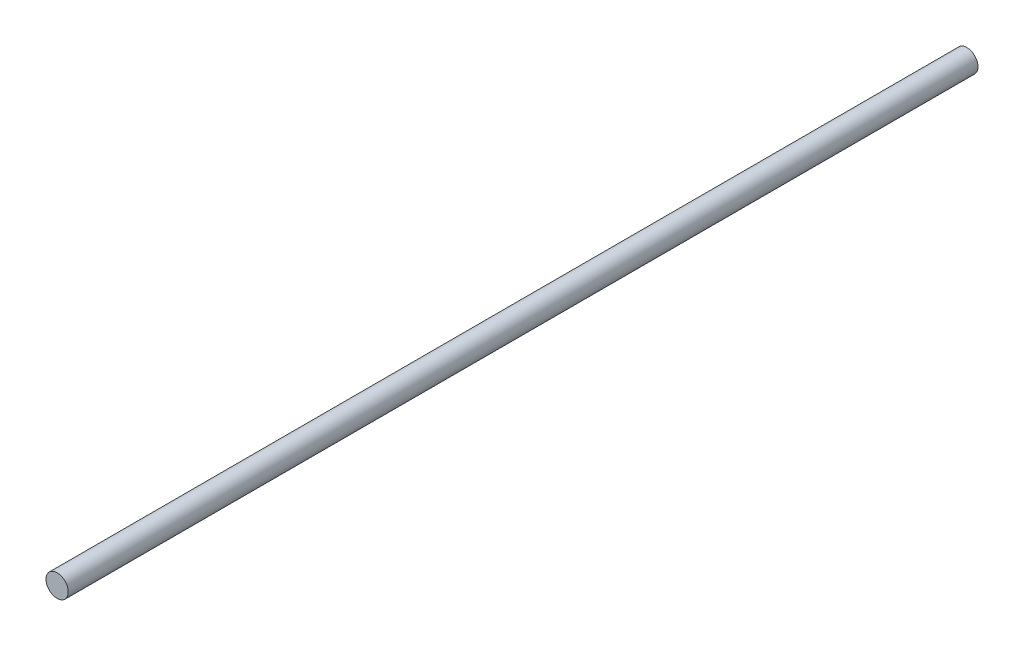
ISO-10303-21;
HEADER;
FILE_DESCRIPTION(('STEP AP214'),'2;1');
FILE_NAME('part.step','',(''),(''),'','','');
FILE_SCHEMA(('AUTOMOTIVE_DESIGN { 1 0 10303 214 1 1 1 1 }'));
ENDSEC;
DATA;
#1=APPLICATION_CONTEXT('core data for automotive mechanical design processes');
#2=APPLICATION_PROTOCOL_DEFINITION('international standard','automotive_design',2000,#1);
#3=PRODUCT_CONTEXT('',#1,'mechanical');
#4=PRODUCT('Part','Part','',(#3));
#5=PRODUCT_RELATED_PRODUCT_CATEGORY('part','',(#4));
#6=PRODUCT_DEFINITION_FORMATION('','',#4);
#7=PRODUCT_DEFINITION_CONTEXT('part definition',#1,'design');
#8=PRODUCT_DEFINITION('design','',#6,#7);
#9=PRODUCT_DEFINITION_SHAPE('','',#8);
#10=(LENGTH_UNIT() NAMED_UNIT(*) SI_UNIT(.MILLI.,.METRE.));
#11=(NAMED_UNIT(*) PLANE_ANGLE_UNIT() SI_UNIT($,.RADIAN.));
#12=(NAMED_UNIT(*) SI_UNIT($,.STERADIAN.) SOLID_ANGLE_UNIT());
#13=UNCERTAINTY_MEASURE_WITH_UNIT(LENGTH_MEASURE(1.E-05),#10,'distance_accuracy_value','');
#14=(GEOMETRIC_REPRESENTATION_CONTEXT(3) GLOBAL_UNCERTAINTY_ASSIGNED_CONTEXT((#13)) GLOBAL_UNIT_ASSIGNED_CONTEXT((#10,
#11,#12)) REPRESENTATION_CONTEXT('',''));
#15=CARTESIAN_POINT('',(0.,0.,0.));
#16=DIRECTION('',(0.,0.,1.));
#17=DIRECTION('',(1.,0.,0.));
#18=AXIS2_PLACEMENT_3D('',#15,#16,#17);
#19=CARTESIAN_POINT('',(0.,0.,-2450.));
#20=DIRECTION('',(0.,0.,1.));
#21=DIRECTION('',(1.,0.,0.));
#22=AXIS2_PLACEMENT_3D('',#19,#20,#21);
#23=CYLINDRICAL_SURFACE('',#22,30.);
#24=CARTESIAN_POINT('',(0.,0.,-2450.));
#25=DIRECTION('',(0.,0.,1.));
#26=DIRECTION('',(1.,0.,0.));
#27=AXIS2_PLACEMENT_3D('',#24,#25,#26);
#28=CIRCLE('',#27,30.);
#29=CARTESIAN_POINT('',(30.,0.,-2450.));
#30=VERTEX_POINT('',#29);
#31=EDGE_CURVE('E10',#30,#30,#28,.T.);
#32=ORIENTED_EDGE('',*,*,#31,.T.);
#33=EDGE_LOOP('',(#32));
#34=FACE_BOUND('',#33,.T.);
#35=CARTESIAN_POINT('',(0.,0.,0.));
#36=DIRECTION('',(0.,0.,1.));
#37=DIRECTION('',(1.,0.,0.));
#38=AXIS2_PLACEMENT_3D('',#35,#36,#37);
#39=CIRCLE('',#38,30.);
#40=CARTESIAN_POINT('',(30.,0.,0.));
#41=VERTEX_POINT('',#40);
#42=EDGE_CURVE('E40',#41,#41,#39,.T.);
#43=ORIENTED_EDGE('',*,*,#42,.F.);
#44=EDGE_LOOP('',(#43));
#45=FACE_BOUND('',#44,.T.);
#46=ADVANCED_FACE('F37',(#34,#45),#23,.T.);
#47=CARTESIAN_POINT('',(0.,0.,-2450.));
#48=DIRECTION('',(0.,0.,1.));
#49=DIRECTION('',(1.,0.,0.));
#50=AXIS2_PLACEMENT_3D('',#47,#48,#49);
#51=PLANE('',#50);
#52=ORIENTED_EDGE('',*,*,#31,.F.);
#53=EDGE_LOOP('',(#52));
#54=FACE_BOUND('',#53,.T.);
#55=ADVANCED_FACE('F54',(#54),#51,.F.);
#56=CARTESIAN_POINT('',(0.,0.,0.));
#57=DIRECTION('',(0.,0.,1.));
#58=DIRECTION('',(1.,0.,0.));
#59=AXIS2_PLACEMENT_3D('',#56,#57,#58);
#60=PLANE('',#59);
#61=ORIENTED_EDGE('',*,*,#42,.T.);
#62=EDGE_LOOP('',(#61));
#63=FACE_BOUND('',#62,.T.);
#64=ADVANCED_FACE('F51',(#63),#60,.T.);
#65=CLOSED_SHELL('',(#46,#55,#64));
#66=MANIFOLD_SOLID_BREP('B2',#65);
#67=ADVANCED_BREP_SHAPE_REPRESENTATION('',(#18,#66),#14);
#68=SHAPE_DEFINITION_REPRESENTATION(#9,#67);
ENDSEC;
END-ISO-10303-21;
